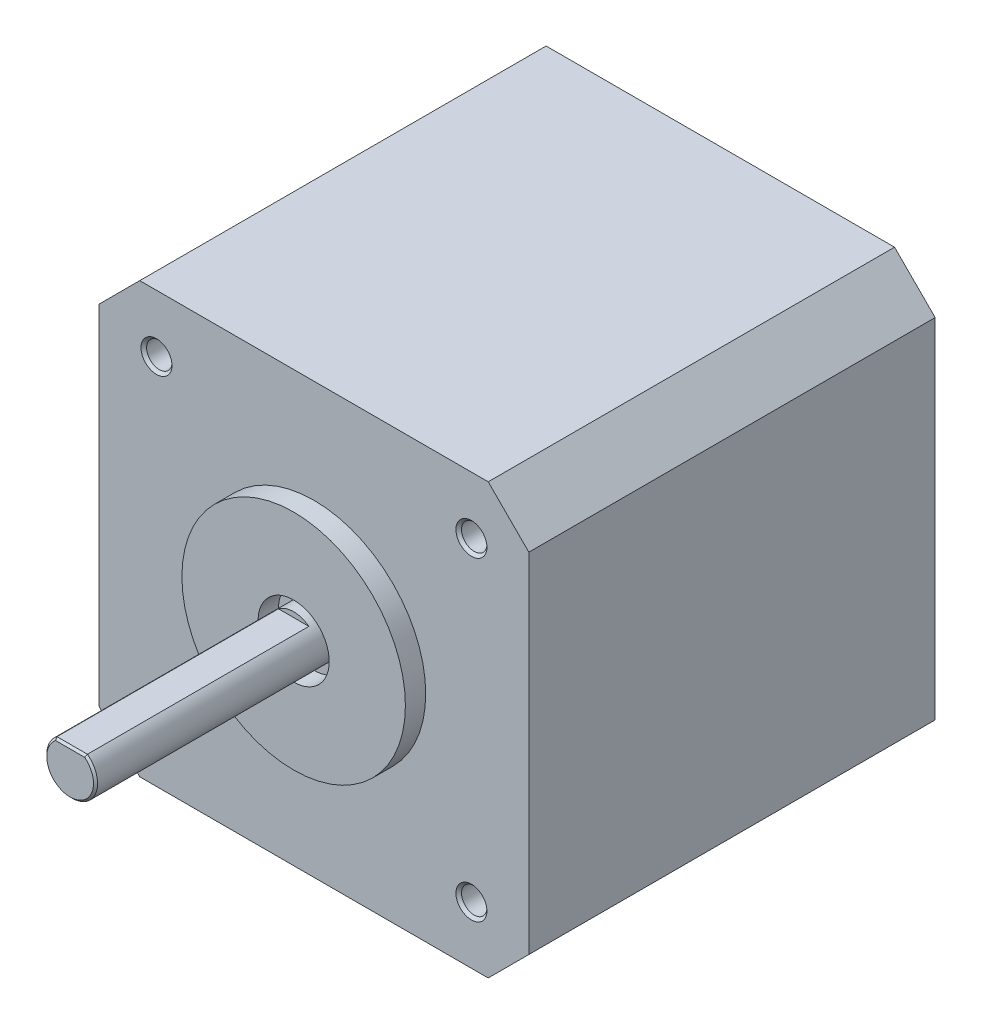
ISO-10303-21;
HEADER;
FILE_DESCRIPTION(('STEP AP214'),'2;1');
FILE_NAME('part.step','',(''),(''),'','','');
FILE_SCHEMA(('AUTOMOTIVE_DESIGN { 1 0 10303 214 1 1 1 1 }'));
ENDSEC;
DATA;
#1=APPLICATION_CONTEXT('core data for automotive mechanical design processes');
#2=APPLICATION_PROTOCOL_DEFINITION('international standard','automotive_design',2000,#1);
#3=PRODUCT_CONTEXT('',#1,'mechanical');
#4=PRODUCT('Part','Part','',(#3));
#5=PRODUCT_RELATED_PRODUCT_CATEGORY('part','',(#4));
#6=PRODUCT_DEFINITION_FORMATION('','',#4);
#7=PRODUCT_DEFINITION_CONTEXT('part definition',#1,'design');
#8=PRODUCT_DEFINITION('design','',#6,#7);
#9=PRODUCT_DEFINITION_SHAPE('','',#8);
#10=(LENGTH_UNIT() NAMED_UNIT(*) SI_UNIT(.MILLI.,.METRE.));
#11=(NAMED_UNIT(*) PLANE_ANGLE_UNIT() SI_UNIT($,.RADIAN.));
#12=(NAMED_UNIT(*) SI_UNIT($,.STERADIAN.) SOLID_ANGLE_UNIT());
#13=UNCERTAINTY_MEASURE_WITH_UNIT(LENGTH_MEASURE(1.E-05),#10,'distance_accuracy_value','');
#14=(GEOMETRIC_REPRESENTATION_CONTEXT(3) GLOBAL_UNCERTAINTY_ASSIGNED_CONTEXT((#13)) GLOBAL_UNIT_ASSIGNED_CONTEXT((#10,
#11,#12)) REPRESENTATION_CONTEXT('',''));
#15=CARTESIAN_POINT('',(0.,0.,0.));
#16=DIRECTION('',(0.,0.,1.));
#17=DIRECTION('',(1.,0.,0.));
#18=AXIS2_PLACEMENT_3D('',#15,#16,#17);
#19=CARTESIAN_POINT('',(21.15,21.15,40.));
#20=DIRECTION('',(-1.,0.,0.));
#21=DIRECTION('',(0.,-1.,0.));
#22=AXIS2_PLACEMENT_3D('',#19,#20,#21);
#23=PLANE('',#22);
#24=DIRECTION('',(0.,1.,0.));
#25=VECTOR('',#24,1.);
#26=CARTESIAN_POINT('',(21.15,21.15,40.));
#27=LINE('',#26,#25);
#28=CARTESIAN_POINT('',(21.15,-17.15,40.));
#29=VERTEX_POINT('',#28);
#30=CARTESIAN_POINT('',(21.15,17.15,40.));
#31=VERTEX_POINT('',#30);
#32=EDGE_CURVE('E209',#29,#31,#27,.T.);
#33=ORIENTED_EDGE('',*,*,#32,.F.);
#34=DIRECTION('',(0.,0.,-1.));
#35=VECTOR('',#34,1.);
#36=CARTESIAN_POINT('',(21.15,-17.15,40.));
#37=LINE('',#36,#35);
#38=CARTESIAN_POINT('',(21.15,-17.15,0.));
#39=VERTEX_POINT('',#38);
#40=EDGE_CURVE('E427',#29,#39,#37,.T.);
#41=ORIENTED_EDGE('',*,*,#40,.T.);
#42=DIRECTION('',(0.,1.,0.));
#43=VECTOR('',#42,1.);
#44=CARTESIAN_POINT('',(21.15,21.15,0.));
#45=LINE('',#44,#43);
#46=CARTESIAN_POINT('',(21.15,17.15,0.));
#47=VERTEX_POINT('',#46);
#48=EDGE_CURVE('E203',#39,#47,#45,.T.);
#49=ORIENTED_EDGE('',*,*,#48,.T.);
#50=DIRECTION('',(0.,0.,1.));
#51=VECTOR('',#50,1.);
#52=CARTESIAN_POINT('',(21.15,17.15,40.));
#53=LINE('',#52,#51);
#54=EDGE_CURVE('E240',#47,#31,#53,.T.);
#55=ORIENTED_EDGE('',*,*,#54,.T.);
#56=EDGE_LOOP('',(#33,#41,#49,#55));
#57=FACE_BOUND('',#56,.T.);
#58=ADVANCED_FACE('F45',(#57),#23,.F.);
#59=CARTESIAN_POINT('',(-21.15,21.15,40.));
#60=DIRECTION('',(0.,-1.,0.));
#61=DIRECTION('',(0.,0.,-1.));
#62=AXIS2_PLACEMENT_3D('',#59,#60,#61);
#63=PLANE('',#62);
#64=DIRECTION('',(-1.,0.,0.));
#65=VECTOR('',#64,1.);
#66=CARTESIAN_POINT('',(-21.15,21.15,40.));
#67=LINE('',#66,#65);
#68=CARTESIAN_POINT('',(17.15,21.15,40.));
#69=VERTEX_POINT('',#68);
#70=CARTESIAN_POINT('',(-17.15,21.15,40.));
#71=VERTEX_POINT('',#70);
#72=EDGE_CURVE('E212',#69,#71,#67,.T.);
#73=ORIENTED_EDGE('',*,*,#72,.F.);
#74=DIRECTION('',(0.,0.,-1.));
#75=VECTOR('',#74,1.);
#76=CARTESIAN_POINT('',(17.15,21.15,40.));
#77=LINE('',#76,#75);
#78=CARTESIAN_POINT('',(17.15,21.15,0.));
#79=VERTEX_POINT('',#78);
#80=EDGE_CURVE('E431',#69,#79,#77,.T.);
#81=ORIENTED_EDGE('',*,*,#80,.T.);
#82=DIRECTION('',(-1.,0.,0.));
#83=VECTOR('',#82,1.);
#84=CARTESIAN_POINT('',(-21.15,21.15,0.));
#85=LINE('',#84,#83);
#86=CARTESIAN_POINT('',(-17.15,21.15,0.));
#87=VERTEX_POINT('',#86);
#88=EDGE_CURVE('E221',#79,#87,#85,.T.);
#89=ORIENTED_EDGE('',*,*,#88,.T.);
#90=DIRECTION('',(0.,0.,1.));
#91=VECTOR('',#90,1.);
#92=CARTESIAN_POINT('',(-17.15,21.15,40.));
#93=LINE('',#92,#91);
#94=EDGE_CURVE('E428',#87,#71,#93,.T.);
#95=ORIENTED_EDGE('',*,*,#94,.T.);
#96=EDGE_LOOP('',(#73,#81,#89,#95));
#97=FACE_BOUND('',#96,.T.);
#98=ADVANCED_FACE('F293',(#97),#63,.F.);
#99=CARTESIAN_POINT('',(-21.15,21.15,40.));
#100=DIRECTION('',(1.,0.,0.));
#101=DIRECTION('',(0.,1.,0.));
#102=AXIS2_PLACEMENT_3D('',#99,#100,#101);
#103=PLANE('',#102);
#104=DIRECTION('',(0.,-1.,0.));
#105=VECTOR('',#104,1.);
#106=CARTESIAN_POINT('',(-21.15,21.15,0.));
#107=LINE('',#106,#105);
#108=CARTESIAN_POINT('',(-21.15,17.15,0.));
#109=VERTEX_POINT('',#108);
#110=CARTESIAN_POINT('',(-21.15,-17.15,0.));
#111=VERTEX_POINT('',#110);
#112=EDGE_CURVE('E224',#109,#111,#107,.T.);
#113=ORIENTED_EDGE('',*,*,#112,.T.);
#114=DIRECTION('',(0.,0.,1.));
#115=VECTOR('',#114,1.);
#116=CARTESIAN_POINT('',(-21.15,-17.15,40.));
#117=LINE('',#116,#115);
#118=CARTESIAN_POINT('',(-21.15,-17.15,40.));
#119=VERTEX_POINT('',#118);
#120=EDGE_CURVE('E11',#111,#119,#117,.T.);
#121=ORIENTED_EDGE('',*,*,#120,.T.);
#122=DIRECTION('',(0.,-1.,0.));
#123=VECTOR('',#122,1.);
#124=CARTESIAN_POINT('',(-21.15,21.15,40.));
#125=LINE('',#124,#123);
#126=CARTESIAN_POINT('',(-21.15,17.15,40.));
#127=VERTEX_POINT('',#126);
#128=EDGE_CURVE('E215',#127,#119,#125,.T.);
#129=ORIENTED_EDGE('',*,*,#128,.F.);
#130=DIRECTION('',(0.,0.,-1.));
#131=VECTOR('',#130,1.);
#132=CARTESIAN_POINT('',(-21.15,17.15,40.));
#133=LINE('',#132,#131);
#134=EDGE_CURVE('E54',#127,#109,#133,.T.);
#135=ORIENTED_EDGE('',*,*,#134,.T.);
#136=EDGE_LOOP('',(#113,#121,#129,#135));
#137=FACE_BOUND('',#136,.T.);
#138=ADVANCED_FACE('F298',(#137),#103,.F.);
#139=CARTESIAN_POINT('',(-21.15,-21.15,40.));
#140=DIRECTION('',(0.,1.,0.));
#141=DIRECTION('',(0.,0.,1.));
#142=AXIS2_PLACEMENT_3D('',#139,#140,#141);
#143=PLANE('',#142);
#144=DIRECTION('',(1.,0.,0.));
#145=VECTOR('',#144,1.);
#146=CARTESIAN_POINT('',(-21.15,-21.15,0.));
#147=LINE('',#146,#145);
#148=CARTESIAN_POINT('',(-17.15,-21.15,0.));
#149=VERTEX_POINT('',#148);
#150=CARTESIAN_POINT('',(17.15,-21.15,0.));
#151=VERTEX_POINT('',#150);
#152=EDGE_CURVE('E213',#149,#151,#147,.T.);
#153=ORIENTED_EDGE('',*,*,#152,.T.);
#154=DIRECTION('',(0.,0.,1.));
#155=VECTOR('',#154,1.);
#156=CARTESIAN_POINT('',(17.15,-21.15,40.));
#157=LINE('',#156,#155);
#158=CARTESIAN_POINT('',(17.15,-21.15,40.));
#159=VERTEX_POINT('',#158);
#160=EDGE_CURVE('E425',#151,#159,#157,.T.);
#161=ORIENTED_EDGE('',*,*,#160,.T.);
#162=DIRECTION('',(1.,0.,0.));
#163=VECTOR('',#162,1.);
#164=CARTESIAN_POINT('',(-21.15,-21.15,40.));
#165=LINE('',#164,#163);
#166=CARTESIAN_POINT('',(-17.15,-21.15,40.));
#167=VERTEX_POINT('',#166);
#168=EDGE_CURVE('E208',#167,#159,#165,.T.);
#169=ORIENTED_EDGE('',*,*,#168,.F.);
#170=DIRECTION('',(0.,0.,-1.));
#171=VECTOR('',#170,1.);
#172=CARTESIAN_POINT('',(-17.15,-21.15,40.));
#173=LINE('',#172,#171);
#174=EDGE_CURVE('E453',#167,#149,#173,.T.);
#175=ORIENTED_EDGE('',*,*,#174,.T.);
#176=EDGE_LOOP('',(#153,#161,#169,#175));
#177=FACE_BOUND('',#176,.T.);
#178=ADVANCED_FACE('F305',(#177),#143,.F.);
#179=CARTESIAN_POINT('',(0.,0.,40.));
#180=DIRECTION('',(0.,0.,1.));
#181=DIRECTION('',(1.,0.,0.));
#182=AXIS2_PLACEMENT_3D('',#179,#180,#181);
#183=PLANE('',#182);
#184=CARTESIAN_POINT('',(15.5,15.5,40.));
#185=DIRECTION('',(0.,0.,1.));
#186=DIRECTION('',(1.,0.,0.));
#187=AXIS2_PLACEMENT_3D('',#184,#185,#186);
#188=CIRCLE('',#187,1.525);
#189=CARTESIAN_POINT('',(17.025,15.5,40.));
#190=VERTEX_POINT('',#189);
#191=EDGE_CURVE('E156',#190,#190,#188,.T.);
#192=ORIENTED_EDGE('',*,*,#191,.F.);
#193=EDGE_LOOP('',(#192));
#194=FACE_BOUND('',#193,.T.);
#195=CARTESIAN_POINT('',(-15.5,15.5,40.));
#196=DIRECTION('',(0.,0.,1.));
#197=DIRECTION('',(1.,0.,0.));
#198=AXIS2_PLACEMENT_3D('',#195,#196,#197);
#199=CIRCLE('',#198,1.525);
#200=CARTESIAN_POINT('',(-13.975,15.5,40.));
#201=VERTEX_POINT('',#200);
#202=EDGE_CURVE('E149',#201,#201,#199,.T.);
#203=ORIENTED_EDGE('',*,*,#202,.F.);
#204=EDGE_LOOP('',(#203));
#205=FACE_BOUND('',#204,.T.);
#206=CARTESIAN_POINT('',(-15.5,-15.5,40.));
#207=DIRECTION('',(0.,0.,1.));
#208=DIRECTION('',(1.,0.,0.));
#209=AXIS2_PLACEMENT_3D('',#206,#207,#208);
#210=CIRCLE('',#209,1.525);
#211=CARTESIAN_POINT('',(-13.975,-15.5,40.));
#212=VERTEX_POINT('',#211);
#213=EDGE_CURVE('E165',#212,#212,#210,.T.);
#214=ORIENTED_EDGE('',*,*,#213,.F.);
#215=EDGE_LOOP('',(#214));
#216=FACE_BOUND('',#215,.T.);
#217=CARTESIAN_POINT('',(15.5,-15.5,40.));
#218=DIRECTION('',(0.,0.,1.));
#219=DIRECTION('',(1.,0.,0.));
#220=AXIS2_PLACEMENT_3D('',#217,#218,#219);
#221=CIRCLE('',#220,1.525);
#222=CARTESIAN_POINT('',(17.025,-15.5,40.));
#223=VERTEX_POINT('',#222);
#224=EDGE_CURVE('E174',#223,#223,#221,.T.);
#225=ORIENTED_EDGE('',*,*,#224,.F.);
#226=EDGE_LOOP('',(#225));
#227=FACE_BOUND('',#226,.T.);
#228=CARTESIAN_POINT('',(0.,0.,40.));
#229=DIRECTION('',(0.,0.,1.));
#230=DIRECTION('',(1.,0.,0.));
#231=AXIS2_PLACEMENT_3D('',#228,#229,#230);
#232=CIRCLE('',#231,11.);
#233=CARTESIAN_POINT('',(11.,0.,40.));
#234=VERTEX_POINT('',#233);
#235=EDGE_CURVE('E204',#234,#234,#232,.T.);
#236=ORIENTED_EDGE('',*,*,#235,.F.);
#237=EDGE_LOOP('',(#236));
#238=FACE_BOUND('',#237,.T.);
#239=ORIENTED_EDGE('',*,*,#168,.T.);
#240=DIRECTION('',(-0.707106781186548,-0.707106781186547,0.));
#241=VECTOR('',#240,1.);
#242=CARTESIAN_POINT('',(19.15,-19.15,40.));
#243=LINE('',#242,#241);
#244=EDGE_CURVE('E419',#159,#29,#243,.F.);
#245=ORIENTED_EDGE('',*,*,#244,.T.);
#246=ORIENTED_EDGE('',*,*,#32,.T.);
#247=DIRECTION('',(0.707106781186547,-0.707106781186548,0.));
#248=VECTOR('',#247,1.);
#249=CARTESIAN_POINT('',(19.15,19.15,40.));
#250=LINE('',#249,#248);
#251=EDGE_CURVE('E429',#31,#69,#250,.F.);
#252=ORIENTED_EDGE('',*,*,#251,.T.);
#253=ORIENTED_EDGE('',*,*,#72,.T.);
#254=DIRECTION('',(0.707106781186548,0.707106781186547,0.));
#255=VECTOR('',#254,1.);
#256=CARTESIAN_POINT('',(-19.15,19.15,40.));
#257=LINE('',#256,#255);
#258=EDGE_CURVE('E66',#71,#127,#257,.F.);
#259=ORIENTED_EDGE('',*,*,#258,.T.);
#260=ORIENTED_EDGE('',*,*,#128,.T.);
#261=DIRECTION('',(-0.707106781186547,0.707106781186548,0.));
#262=VECTOR('',#261,1.);
#263=CARTESIAN_POINT('',(-19.15,-19.15,40.));
#264=LINE('',#263,#262);
#265=EDGE_CURVE('E420',#119,#167,#264,.F.);
#266=ORIENTED_EDGE('',*,*,#265,.T.);
#267=EDGE_LOOP('',(#239,#245,#246,#252,#253,#259,#260,#266));
#268=FACE_BOUND('',#267,.T.);
#269=ADVANCED_FACE('F308',(#194,#205,#216,#227,#238,#268),#183,.T.);
#270=CARTESIAN_POINT('',(0.,0.,0.));
#271=DIRECTION('',(0.,0.,1.));
#272=DIRECTION('',(1.,0.,0.));
#273=AXIS2_PLACEMENT_3D('',#270,#271,#272);
#274=PLANE('',#273);
#275=ORIENTED_EDGE('',*,*,#48,.F.);
#276=DIRECTION('',(0.707106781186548,0.707106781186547,0.));
#277=VECTOR('',#276,1.);
#278=CARTESIAN_POINT('',(21.15,-17.15,0.));
#279=LINE('',#278,#277);
#280=EDGE_CURVE('E447',#39,#151,#279,.F.);
#281=ORIENTED_EDGE('',*,*,#280,.T.);
#282=ORIENTED_EDGE('',*,*,#152,.F.);
#283=DIRECTION('',(0.707106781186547,-0.707106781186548,0.));
#284=VECTOR('',#283,1.);
#285=CARTESIAN_POINT('',(-17.15,-21.15,0.));
#286=LINE('',#285,#284);
#287=EDGE_CURVE('E444',#149,#111,#286,.F.);
#288=ORIENTED_EDGE('',*,*,#287,.T.);
#289=ORIENTED_EDGE('',*,*,#112,.F.);
#290=DIRECTION('',(-0.707106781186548,-0.707106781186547,0.));
#291=VECTOR('',#290,1.);
#292=CARTESIAN_POINT('',(-21.15,17.15,0.));
#293=LINE('',#292,#291);
#294=EDGE_CURVE('E442',#109,#87,#293,.F.);
#295=ORIENTED_EDGE('',*,*,#294,.T.);
#296=ORIENTED_EDGE('',*,*,#88,.F.);
#297=DIRECTION('',(-0.707106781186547,0.707106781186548,0.));
#298=VECTOR('',#297,1.);
#299=CARTESIAN_POINT('',(17.15,21.15,0.));
#300=LINE('',#299,#298);
#301=EDGE_CURVE('E445',#79,#47,#300,.F.);
#302=ORIENTED_EDGE('',*,*,#301,.T.);
#303=EDGE_LOOP('',(#275,#281,#282,#288,#289,#295,#296,#302));
#304=FACE_BOUND('',#303,.T.);
#305=ADVANCED_FACE('F310',(#304),#274,.F.);
#306=CARTESIAN_POINT('',(0.,0.,42.));
#307=DIRECTION('',(0.,0.,-1.));
#308=DIRECTION('',(-1.,0.,0.));
#309=AXIS2_PLACEMENT_3D('',#306,#307,#308);
#310=CYLINDRICAL_SURFACE('',#309,11.);
#311=CARTESIAN_POINT('',(0.,0.,42.));
#312=DIRECTION('',(0.,0.,1.));
#313=DIRECTION('',(1.,0.,0.));
#314=AXIS2_PLACEMENT_3D('',#311,#312,#313);
#315=CIRCLE('',#314,11.);
#316=CARTESIAN_POINT('',(11.,0.,42.));
#317=VERTEX_POINT('',#316);
#318=EDGE_CURVE('E198',#317,#317,#315,.T.);
#319=ORIENTED_EDGE('',*,*,#318,.F.);
#320=EDGE_LOOP('',(#319));
#321=FACE_BOUND('',#320,.T.);
#322=ORIENTED_EDGE('',*,*,#235,.T.);
#323=EDGE_LOOP('',(#322));
#324=FACE_BOUND('',#323,.T.);
#325=ADVANCED_FACE('F313',(#321,#324),#310,.T.);
#326=CARTESIAN_POINT('',(0.,0.,42.));
#327=DIRECTION('',(0.,0.,1.));
#328=DIRECTION('',(1.,0.,0.));
#329=AXIS2_PLACEMENT_3D('',#326,#327,#328);
#330=PLANE('',#329);
#331=CARTESIAN_POINT('',(0.,0.,42.));
#332=DIRECTION('',(0.,0.,1.));
#333=DIRECTION('',(1.,0.,0.));
#334=AXIS2_PLACEMENT_3D('',#331,#332,#333);
#335=CIRCLE('',#334,3.5);
#336=CARTESIAN_POINT('',(3.5,0.,42.));
#337=VERTEX_POINT('',#336);
#338=EDGE_CURVE('E194',#337,#337,#335,.T.);
#339=ORIENTED_EDGE('',*,*,#338,.F.);
#340=EDGE_LOOP('',(#339));
#341=FACE_BOUND('',#340,.T.);
#342=ORIENTED_EDGE('',*,*,#318,.T.);
#343=EDGE_LOOP('',(#342));
#344=FACE_BOUND('',#343,.T.);
#345=ADVANCED_FACE('F320',(#341,#344),#330,.T.);
#346=CARTESIAN_POINT('',(0.,0.,40.));
#347=DIRECTION('',(0.,0.,1.));
#348=DIRECTION('',(1.,0.,0.));
#349=AXIS2_PLACEMENT_3D('',#346,#347,#348);
#350=CYLINDRICAL_SURFACE('',#349,3.5);
#351=CARTESIAN_POINT('',(0.,0.,40.));
#352=DIRECTION('',(0.,0.,1.));
#353=DIRECTION('',(1.,0.,0.));
#354=AXIS2_PLACEMENT_3D('',#351,#352,#353);
#355=CIRCLE('',#354,3.5);
#356=CARTESIAN_POINT('',(3.5,0.,40.));
#357=VERTEX_POINT('',#356);
#358=EDGE_CURVE('E195',#357,#357,#355,.T.);
#359=ORIENTED_EDGE('',*,*,#358,.F.);
#360=EDGE_LOOP('',(#359));
#361=FACE_BOUND('',#360,.T.);
#362=ORIENTED_EDGE('',*,*,#338,.T.);
#363=EDGE_LOOP('',(#362));
#364=FACE_BOUND('',#363,.T.);
#365=ADVANCED_FACE('F324',(#361,#364),#350,.F.);
#366=CARTESIAN_POINT('',(0.,0.,40.));
#367=DIRECTION('',(0.,0.,1.));
#368=DIRECTION('',(1.,0.,0.));
#369=AXIS2_PLACEMENT_3D('',#366,#367,#368);
#370=PLANE('',#369);
#371=CARTESIAN_POINT('',(0.,0.,40.));
#372=DIRECTION('',(0.,0.,1.));
#373=DIRECTION('',(1.,0.,0.));
#374=AXIS2_PLACEMENT_3D('',#371,#372,#373);
#375=CIRCLE('',#374,2.5);
#376=CARTESIAN_POINT('',(2.5,0.,40.));
#377=VERTEX_POINT('',#376);
#378=EDGE_CURVE('E191',#377,#377,#375,.T.);
#379=ORIENTED_EDGE('',*,*,#378,.F.);
#380=EDGE_LOOP('',(#379));
#381=FACE_BOUND('',#380,.T.);
#382=ORIENTED_EDGE('',*,*,#358,.T.);
#383=EDGE_LOOP('',(#382));
#384=FACE_BOUND('',#383,.T.);
#385=ADVANCED_FACE('F328',(#381,#384),#370,.T.);
#386=CARTESIAN_POINT('',(0.,0.,64.));
#387=DIRECTION('',(0.,0.,-1.));
#388=DIRECTION('',(-1.,0.,0.));
#389=AXIS2_PLACEMENT_3D('',#386,#387,#388);
#390=CYLINDRICAL_SURFACE('',#389,2.5);
#391=DIRECTION('',(0.,0.,-1.));
#392=VECTOR('',#391,1.);
#393=CARTESIAN_POINT('',(1.5,2.,64.));
#394=LINE('',#393,#392);
#395=CARTESIAN_POINT('',(1.5,2.,42.));
#396=VERTEX_POINT('',#395);
#397=CARTESIAN_POINT('',(1.5,2.,63.8));
#398=VERTEX_POINT('',#397);
#399=EDGE_CURVE('E186',#396,#398,#394,.F.);
#400=ORIENTED_EDGE('',*,*,#399,.T.);
#401=CARTESIAN_POINT('',(0.,0.,63.8));
#402=DIRECTION('',(0.,0.,1.));
#403=DIRECTION('',(1.,0.,0.));
#404=AXIS2_PLACEMENT_3D('',#401,#402,#403);
#405=CIRCLE('',#404,2.5);
#406=CARTESIAN_POINT('',(-1.5,2.,63.8));
#407=VERTEX_POINT('',#406);
#408=EDGE_CURVE('E235',#398,#407,#405,.F.);
#409=ORIENTED_EDGE('',*,*,#408,.T.);
#410=DIRECTION('',(0.,0.,-1.));
#411=VECTOR('',#410,1.);
#412=CARTESIAN_POINT('',(-1.5,2.,64.));
#413=LINE('',#412,#411);
#414=CARTESIAN_POINT('',(-1.5,2.,42.));
#415=VERTEX_POINT('',#414);
#416=EDGE_CURVE('E189',#407,#415,#413,.T.);
#417=ORIENTED_EDGE('',*,*,#416,.T.);
#418=CARTESIAN_POINT('',(0.,0.,42.));
#419=DIRECTION('',(0.,0.,1.));
#420=DIRECTION('',(1.,0.,0.));
#421=AXIS2_PLACEMENT_3D('',#418,#419,#420);
#422=CIRCLE('',#421,2.5);
#423=EDGE_CURVE('E207',#396,#415,#422,.T.);
#424=ORIENTED_EDGE('',*,*,#423,.F.);
#425=EDGE_LOOP('',(#400,#409,#417,#424));
#426=FACE_BOUND('',#425,.T.);
#427=ORIENTED_EDGE('',*,*,#378,.T.);
#428=EDGE_LOOP('',(#427));
#429=FACE_BOUND('',#428,.T.);
#430=ADVANCED_FACE('F332',(#426,#429),#390,.T.);
#431=CARTESIAN_POINT('',(0.,0.,64.));
#432=DIRECTION('',(0.,0.,1.));
#433=DIRECTION('',(1.,0.,0.));
#434=AXIS2_PLACEMENT_3D('',#431,#432,#433);
#435=PLANE('',#434);
#436=DIRECTION('',(-1.,0.,0.));
#437=VECTOR('',#436,1.);
#438=CARTESIAN_POINT('',(-1.5,1.79999999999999,64.));
#439=LINE('',#438,#437);
#440=CARTESIAN_POINT('',(1.43178210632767,1.79999999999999,64.));
#441=VERTEX_POINT('',#440);
#442=CARTESIAN_POINT('',(-1.43178210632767,1.79999999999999,64.));
#443=VERTEX_POINT('',#442);
#444=EDGE_CURVE('E230',#441,#443,#439,.T.);
#445=ORIENTED_EDGE('',*,*,#444,.T.);
#446=CARTESIAN_POINT('',(0.,0.,64.));
#447=DIRECTION('',(0.,0.,1.));
#448=DIRECTION('',(1.,0.,0.));
#449=AXIS2_PLACEMENT_3D('',#446,#447,#448);
#450=CIRCLE('',#449,2.29999999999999);
#451=EDGE_CURVE('E232',#443,#441,#450,.T.);
#452=ORIENTED_EDGE('',*,*,#451,.T.);
#453=EDGE_LOOP('',(#445,#452));
#454=FACE_BOUND('',#453,.T.);
#455=ADVANCED_FACE('F336',(#454),#435,.T.);
#456=CARTESIAN_POINT('',(0.,0.,42.));
#457=DIRECTION('',(0.,0.,1.));
#458=DIRECTION('',(1.,0.,0.));
#459=AXIS2_PLACEMENT_3D('',#456,#457,#458);
#460=PLANE('',#459);
#461=ORIENTED_EDGE('',*,*,#423,.T.);
#462=DIRECTION('',(1.,0.,0.));
#463=VECTOR('',#462,1.);
#464=CARTESIAN_POINT('',(-2.5,2.,42.));
#465=LINE('',#464,#463);
#466=EDGE_CURVE('E183',#415,#396,#465,.T.);
#467=ORIENTED_EDGE('',*,*,#466,.T.);
#468=EDGE_LOOP('',(#461,#467));
#469=FACE_BOUND('',#468,.T.);
#470=ADVANCED_FACE('F340',(#469),#460,.T.);
#471=CARTESIAN_POINT('',(-2.5,2.,42.));
#472=DIRECTION('',(0.,-1.,0.));
#473=DIRECTION('',(0.,0.,-1.));
#474=AXIS2_PLACEMENT_3D('',#471,#472,#473);
#475=PLANE('',#474);
#476=ORIENTED_EDGE('',*,*,#416,.F.);
#477=DIRECTION('',(1.,0.,0.));
#478=VECTOR('',#477,1.);
#479=CARTESIAN_POINT('',(1.5,2.,63.8));
#480=LINE('',#479,#478);
#481=EDGE_CURVE('E238',#407,#398,#480,.T.);
#482=ORIENTED_EDGE('',*,*,#481,.T.);
#483=ORIENTED_EDGE('',*,*,#399,.F.);
#484=ORIENTED_EDGE('',*,*,#466,.F.);
#485=EDGE_LOOP('',(#476,#482,#483,#484));
#486=FACE_BOUND('',#485,.T.);
#487=ADVANCED_FACE('F342',(#486),#475,.F.);
#488=CARTESIAN_POINT('',(15.5,-15.5,31.5));
#489=DIRECTION('',(0.,0.,1.));
#490=DIRECTION('',(1.,0.,0.));
#491=AXIS2_PLACEMENT_3D('',#488,#489,#490);
#492=CONICAL_SURFACE('',#491,1.25,1.02974425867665);
#493=CARTESIAN_POINT('',(15.5,-15.5,30.7489242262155));
#494=VERTEX_POINT('',#493);
#495=VERTEX_LOOP('',#494);
#496=FACE_BOUND('',#495,.T.);
#497=CARTESIAN_POINT('',(15.5,-15.5,31.5));
#498=DIRECTION('',(0.,0.,1.));
#499=DIRECTION('',(1.,0.,0.));
#500=AXIS2_PLACEMENT_3D('',#497,#498,#499);
#501=CIRCLE('',#500,1.25);
#502=CARTESIAN_POINT('',(16.75,-15.5,31.5));
#503=VERTEX_POINT('',#502);
#504=EDGE_CURVE('E180',#503,#503,#501,.T.);
#505=ORIENTED_EDGE('',*,*,#504,.T.);
#506=EDGE_LOOP('',(#505));
#507=FACE_BOUND('',#506,.T.);
#508=ADVANCED_FACE('F345',(#496,#507),#492,.F.);
#509=CARTESIAN_POINT('',(15.5,-15.5,40.));
#510=DIRECTION('',(0.,0.,1.));
#511=DIRECTION('',(1.,0.,0.));
#512=AXIS2_PLACEMENT_3D('',#509,#510,#511);
#513=CYLINDRICAL_SURFACE('',#512,1.25);
#514=ORIENTED_EDGE('',*,*,#504,.F.);
#515=EDGE_LOOP('',(#514));
#516=FACE_BOUND('',#515,.T.);
#517=CARTESIAN_POINT('',(15.5,-15.5,39.725));
#518=DIRECTION('',(0.,0.,1.));
#519=DIRECTION('',(1.,0.,0.));
#520=AXIS2_PLACEMENT_3D('',#517,#518,#519);
#521=CIRCLE('',#520,1.25);
#522=CARTESIAN_POINT('',(16.75,-15.5,39.725));
#523=VERTEX_POINT('',#522);
#524=EDGE_CURVE('E177',#523,#523,#521,.T.);
#525=ORIENTED_EDGE('',*,*,#524,.T.);
#526=EDGE_LOOP('',(#525));
#527=FACE_BOUND('',#526,.T.);
#528=ADVANCED_FACE('F352',(#516,#527),#513,.F.);
#529=CARTESIAN_POINT('',(15.5,-15.5,40.));
#530=DIRECTION('',(0.,0.,1.));
#531=DIRECTION('',(1.,0.,0.));
#532=AXIS2_PLACEMENT_3D('',#529,#530,#531);
#533=CONICAL_SURFACE('',#532,1.525,0.785398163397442);
#534=ORIENTED_EDGE('',*,*,#524,.F.);
#535=EDGE_LOOP('',(#534));
#536=FACE_BOUND('',#535,.T.);
#537=ORIENTED_EDGE('',*,*,#224,.T.);
#538=EDGE_LOOP('',(#537));
#539=FACE_BOUND('',#538,.T.);
#540=ADVANCED_FACE('F356',(#536,#539),#533,.F.);
#541=CARTESIAN_POINT('',(-15.5,-15.5,31.5));
#542=DIRECTION('',(0.,0.,1.));
#543=DIRECTION('',(1.,0.,0.));
#544=AXIS2_PLACEMENT_3D('',#541,#542,#543);
#545=CONICAL_SURFACE('',#544,1.25,1.02974425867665);
#546=CARTESIAN_POINT('',(-15.5,-15.5,30.7489242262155));
#547=VERTEX_POINT('',#546);
#548=VERTEX_LOOP('',#547);
#549=FACE_BOUND('',#548,.T.);
#550=CARTESIAN_POINT('',(-15.5,-15.5,31.5));
#551=DIRECTION('',(0.,0.,1.));
#552=DIRECTION('',(1.,0.,0.));
#553=AXIS2_PLACEMENT_3D('',#550,#551,#552);
#554=CIRCLE('',#553,1.25);
#555=CARTESIAN_POINT('',(-14.25,-15.5,31.5));
#556=VERTEX_POINT('',#555);
#557=EDGE_CURVE('E171',#556,#556,#554,.T.);
#558=ORIENTED_EDGE('',*,*,#557,.T.);
#559=EDGE_LOOP('',(#558));
#560=FACE_BOUND('',#559,.T.);
#561=ADVANCED_FACE('F360',(#549,#560),#545,.F.);
#562=CARTESIAN_POINT('',(-15.5,-15.5,40.));
#563=DIRECTION('',(0.,0.,1.));
#564=DIRECTION('',(1.,0.,0.));
#565=AXIS2_PLACEMENT_3D('',#562,#563,#564);
#566=CYLINDRICAL_SURFACE('',#565,1.25);
#567=ORIENTED_EDGE('',*,*,#557,.F.);
#568=EDGE_LOOP('',(#567));
#569=FACE_BOUND('',#568,.T.);
#570=CARTESIAN_POINT('',(-15.5,-15.5,39.725));
#571=DIRECTION('',(0.,0.,1.));
#572=DIRECTION('',(1.,0.,0.));
#573=AXIS2_PLACEMENT_3D('',#570,#571,#572);
#574=CIRCLE('',#573,1.25);
#575=CARTESIAN_POINT('',(-14.25,-15.5,39.725));
#576=VERTEX_POINT('',#575);
#577=EDGE_CURVE('E168',#576,#576,#574,.T.);
#578=ORIENTED_EDGE('',*,*,#577,.T.);
#579=EDGE_LOOP('',(#578));
#580=FACE_BOUND('',#579,.T.);
#581=ADVANCED_FACE('F364',(#569,#580),#566,.F.);
#582=CARTESIAN_POINT('',(-15.5,-15.5,40.));
#583=DIRECTION('',(0.,0.,1.));
#584=DIRECTION('',(1.,0.,0.));
#585=AXIS2_PLACEMENT_3D('',#582,#583,#584);
#586=CONICAL_SURFACE('',#585,1.525,0.785398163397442);
#587=ORIENTED_EDGE('',*,*,#577,.F.);
#588=EDGE_LOOP('',(#587));
#589=FACE_BOUND('',#588,.T.);
#590=ORIENTED_EDGE('',*,*,#213,.T.);
#591=EDGE_LOOP('',(#590));
#592=FACE_BOUND('',#591,.T.);
#593=ADVANCED_FACE('F368',(#589,#592),#586,.F.);
#594=CARTESIAN_POINT('',(-15.5,15.5,31.5));
#595=DIRECTION('',(0.,0.,1.));
#596=DIRECTION('',(1.,0.,0.));
#597=AXIS2_PLACEMENT_3D('',#594,#595,#596);
#598=CONICAL_SURFACE('',#597,1.25,1.02974425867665);
#599=CARTESIAN_POINT('',(-15.5,15.5,30.7489242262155));
#600=VERTEX_POINT('',#599);
#601=VERTEX_LOOP('',#600);
#602=FACE_BOUND('',#601,.T.);
#603=CARTESIAN_POINT('',(-15.5,15.5,31.5));
#604=DIRECTION('',(0.,0.,1.));
#605=DIRECTION('',(1.,0.,0.));
#606=AXIS2_PLACEMENT_3D('',#603,#604,#605);
#607=CIRCLE('',#606,1.25);
#608=CARTESIAN_POINT('',(-14.25,15.5,31.5));
#609=VERTEX_POINT('',#608);
#610=EDGE_CURVE('E162',#609,#609,#607,.T.);
#611=ORIENTED_EDGE('',*,*,#610,.T.);
#612=EDGE_LOOP('',(#611));
#613=FACE_BOUND('',#612,.T.);
#614=ADVANCED_FACE('F372',(#602,#613),#598,.F.);
#615=CARTESIAN_POINT('',(-15.5,15.5,40.));
#616=DIRECTION('',(0.,0.,1.));
#617=DIRECTION('',(1.,0.,0.));
#618=AXIS2_PLACEMENT_3D('',#615,#616,#617);
#619=CYLINDRICAL_SURFACE('',#618,1.25);
#620=ORIENTED_EDGE('',*,*,#610,.F.);
#621=EDGE_LOOP('',(#620));
#622=FACE_BOUND('',#621,.T.);
#623=CARTESIAN_POINT('',(-15.5,15.5,39.725));
#624=DIRECTION('',(0.,0.,1.));
#625=DIRECTION('',(1.,0.,0.));
#626=AXIS2_PLACEMENT_3D('',#623,#624,#625);
#627=CIRCLE('',#626,1.25);
#628=CARTESIAN_POINT('',(-14.25,15.5,39.725));
#629=VERTEX_POINT('',#628);
#630=EDGE_CURVE('E153',#629,#629,#627,.T.);
#631=ORIENTED_EDGE('',*,*,#630,.T.);
#632=EDGE_LOOP('',(#631));
#633=FACE_BOUND('',#632,.T.);
#634=ADVANCED_FACE('F376',(#622,#633),#619,.F.);
#635=CARTESIAN_POINT('',(-15.5,15.5,40.));
#636=DIRECTION('',(0.,0.,1.));
#637=DIRECTION('',(1.,0.,0.));
#638=AXIS2_PLACEMENT_3D('',#635,#636,#637);
#639=CONICAL_SURFACE('',#638,1.525,0.785398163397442);
#640=ORIENTED_EDGE('',*,*,#630,.F.);
#641=EDGE_LOOP('',(#640));
#642=FACE_BOUND('',#641,.T.);
#643=ORIENTED_EDGE('',*,*,#202,.T.);
#644=EDGE_LOOP('',(#643));
#645=FACE_BOUND('',#644,.T.);
#646=ADVANCED_FACE('F143',(#642,#645),#639,.F.);
#647=CARTESIAN_POINT('',(15.5,15.5,31.5));
#648=DIRECTION('',(0.,0.,1.));
#649=DIRECTION('',(1.,0.,0.));
#650=AXIS2_PLACEMENT_3D('',#647,#648,#649);
#651=CONICAL_SURFACE('',#650,1.25,1.02974425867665);
#652=CARTESIAN_POINT('',(15.5,15.5,30.7489242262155));
#653=VERTEX_POINT('',#652);
#654=VERTEX_LOOP('',#653);
#655=FACE_BOUND('',#654,.T.);
#656=CARTESIAN_POINT('',(15.5,15.5,31.5));
#657=DIRECTION('',(0.,0.,1.));
#658=DIRECTION('',(1.,0.,0.));
#659=AXIS2_PLACEMENT_3D('',#656,#657,#658);
#660=CIRCLE('',#659,1.25);
#661=CARTESIAN_POINT('',(16.75,15.5,31.5));
#662=VERTEX_POINT('',#661);
#663=EDGE_CURVE('E147',#662,#662,#660,.T.);
#664=ORIENTED_EDGE('',*,*,#663,.T.);
#665=EDGE_LOOP('',(#664));
#666=FACE_BOUND('',#665,.T.);
#667=ADVANCED_FACE('F139',(#655,#666),#651,.F.);
#668=CARTESIAN_POINT('',(15.5,15.5,40.));
#669=DIRECTION('',(0.,0.,1.));
#670=DIRECTION('',(1.,0.,0.));
#671=AXIS2_PLACEMENT_3D('',#668,#669,#670);
#672=CYLINDRICAL_SURFACE('',#671,1.25);
#673=ORIENTED_EDGE('',*,*,#663,.F.);
#674=EDGE_LOOP('',(#673));
#675=FACE_BOUND('',#674,.T.);
#676=CARTESIAN_POINT('',(15.5,15.5,39.725));
#677=DIRECTION('',(0.,0.,1.));
#678=DIRECTION('',(1.,0.,0.));
#679=AXIS2_PLACEMENT_3D('',#676,#677,#678);
#680=CIRCLE('',#679,1.25);
#681=CARTESIAN_POINT('',(16.75,15.5,39.725));
#682=VERTEX_POINT('',#681);
#683=EDGE_CURVE('E150',#682,#682,#680,.T.);
#684=ORIENTED_EDGE('',*,*,#683,.T.);
#685=EDGE_LOOP('',(#684));
#686=FACE_BOUND('',#685,.T.);
#687=ADVANCED_FACE('F142',(#675,#686),#672,.F.);
#688=CARTESIAN_POINT('',(15.5,15.5,40.));
#689=DIRECTION('',(0.,0.,1.));
#690=DIRECTION('',(1.,0.,0.));
#691=AXIS2_PLACEMENT_3D('',#688,#689,#690);
#692=CONICAL_SURFACE('',#691,1.525,0.785398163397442);
#693=ORIENTED_EDGE('',*,*,#683,.F.);
#694=EDGE_LOOP('',(#693));
#695=FACE_BOUND('',#694,.T.);
#696=ORIENTED_EDGE('',*,*,#191,.T.);
#697=EDGE_LOOP('',(#696));
#698=FACE_BOUND('',#697,.T.);
#699=ADVANCED_FACE('F386',(#695,#698),#692,.F.);
#700=CARTESIAN_POINT('',(-2.5,2.,63.8));
#701=DIRECTION('',(0.,0.707106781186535,0.70710678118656));
#702=DIRECTION('',(-1.,0.,0.));
#703=AXIS2_PLACEMENT_3D('',#700,#701,#702);
#704=PLANE('',#703);
#705=CARTESIAN_POINT('',(1.43178210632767,1.79999999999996,64.));
#706=CARTESIAN_POINT('',(1.44340173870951,1.83329071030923,63.9667092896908));
#707=CARTESIAN_POINT('',(1.45489638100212,1.86660273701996,63.93339726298));
#708=CARTESIAN_POINT('',(1.47763567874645,1.93326940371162,63.8667305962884));
#709=CARTESIAN_POINT('',(1.48888033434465,1.96662404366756,63.8333759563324));
#710=CARTESIAN_POINT('',(1.50000000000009,1.99999999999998,63.8));
#711=B_SPLINE_CURVE_WITH_KNOTS('',3,(#705,#706,#707,#708,#709,#710),.UNSPECIFIED.,.F.,.F.,(4,2,
4),(0.,0.14547708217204,0.290954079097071),.UNSPECIFIED.);
#712=EDGE_CURVE('E241',#398,#441,#711,.F.);
#713=ORIENTED_EDGE('',*,*,#712,.F.);
#714=ORIENTED_EDGE('',*,*,#481,.F.);
#715=CARTESIAN_POINT('',(-1.5,2.,63.8));
#716=CARTESIAN_POINT('',(-1.48888033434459,1.96662404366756,63.8333759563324));
#717=CARTESIAN_POINT('',(-1.47763567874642,1.93326940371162,63.8667305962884));
#718=CARTESIAN_POINT('',(-1.45489638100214,1.86660273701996,63.93339726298));
#719=CARTESIAN_POINT('',(-1.44340173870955,1.83329071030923,63.9667092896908));
#720=CARTESIAN_POINT('',(-1.43178210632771,1.79999999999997,64.));
#721=B_SPLINE_CURVE_WITH_KNOTS('',3,(#715,#716,#717,#718,#719,#720),.UNSPECIFIED.,.F.,.F.,(4,2,
4),(0.,0.14547699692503,0.290954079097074),.UNSPECIFIED.);
#722=EDGE_CURVE('E249',#443,#407,#721,.F.);
#723=ORIENTED_EDGE('',*,*,#722,.F.);
#724=ORIENTED_EDGE('',*,*,#444,.F.);
#725=EDGE_LOOP('',(#713,#714,#723,#724));
#726=FACE_BOUND('',#725,.T.);
#727=ADVANCED_FACE('F256',(#726),#704,.T.);
#728=CARTESIAN_POINT('',(0.,0.,64.));
#729=DIRECTION('',(0.,0.,-1.));
#730=DIRECTION('',(-1.,0.,0.));
#731=AXIS2_PLACEMENT_3D('',#728,#729,#730);
#732=CONICAL_SURFACE('',#731,2.29999999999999,0.785398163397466);
#733=ORIENTED_EDGE('',*,*,#722,.T.);
#734=ORIENTED_EDGE('',*,*,#408,.F.);
#735=ORIENTED_EDGE('',*,*,#712,.T.);
#736=ORIENTED_EDGE('',*,*,#451,.F.);
#737=EDGE_LOOP('',(#733,#734,#735,#736));
#738=FACE_BOUND('',#737,.T.);
#739=ADVANCED_FACE('F260',(#738),#732,.T.);
#740=CARTESIAN_POINT('',(21.15,-17.15,40.));
#741=DIRECTION('',(-0.707106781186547,0.707106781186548,0.));
#742=DIRECTION('',(0.,0.,-1.));
#743=AXIS2_PLACEMENT_3D('',#740,#741,#742);
#744=PLANE('',#743);
#745=ORIENTED_EDGE('',*,*,#244,.F.);
#746=ORIENTED_EDGE('',*,*,#160,.F.);
#747=ORIENTED_EDGE('',*,*,#280,.F.);
#748=ORIENTED_EDGE('',*,*,#40,.F.);
#749=EDGE_LOOP('',(#745,#746,#747,#748));
#750=FACE_BOUND('',#749,.T.);
#751=ADVANCED_FACE('F266',(#750),#744,.F.);
#752=CARTESIAN_POINT('',(17.15,21.15,40.));
#753=DIRECTION('',(-0.707106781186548,-0.707106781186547,0.));
#754=DIRECTION('',(0.,0.,-1.));
#755=AXIS2_PLACEMENT_3D('',#752,#753,#754);
#756=PLANE('',#755);
#757=ORIENTED_EDGE('',*,*,#251,.F.);
#758=ORIENTED_EDGE('',*,*,#54,.F.);
#759=ORIENTED_EDGE('',*,*,#301,.F.);
#760=ORIENTED_EDGE('',*,*,#80,.F.);
#761=EDGE_LOOP('',(#757,#758,#759,#760));
#762=FACE_BOUND('',#761,.T.);
#763=ADVANCED_FACE('F275',(#762),#756,.F.);
#764=CARTESIAN_POINT('',(-17.15,-21.15,40.));
#765=DIRECTION('',(0.707106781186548,0.707106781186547,0.));
#766=DIRECTION('',(0.,0.,-1.));
#767=AXIS2_PLACEMENT_3D('',#764,#765,#766);
#768=PLANE('',#767);
#769=ORIENTED_EDGE('',*,*,#265,.F.);
#770=ORIENTED_EDGE('',*,*,#120,.F.);
#771=ORIENTED_EDGE('',*,*,#287,.F.);
#772=ORIENTED_EDGE('',*,*,#174,.F.);
#773=EDGE_LOOP('',(#769,#770,#771,#772));
#774=FACE_BOUND('',#773,.T.);
#775=ADVANCED_FACE('F281',(#774),#768,.F.);
#776=CARTESIAN_POINT('',(-21.15,17.15,40.));
#777=DIRECTION('',(0.707106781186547,-0.707106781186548,0.));
#778=DIRECTION('',(0.,0.,-1.));
#779=AXIS2_PLACEMENT_3D('',#776,#777,#778);
#780=PLANE('',#779);
#781=ORIENTED_EDGE('',*,*,#258,.F.);
#782=ORIENTED_EDGE('',*,*,#94,.F.);
#783=ORIENTED_EDGE('',*,*,#294,.F.);
#784=ORIENTED_EDGE('',*,*,#134,.F.);
#785=EDGE_LOOP('',(#781,#782,#783,#784));
#786=FACE_BOUND('',#785,.T.);
#787=ADVANCED_FACE('F48',(#786),#780,.F.);
#788=CLOSED_SHELL('',(#58,#98,#138,#178,#269,#305,#325,#345,#365,#385,#430,#455,#470,#487,#508,
#528,#540,#561,#581,#593,#614,#634,#646,#667,#687,#699,#727,#739,#751,#763,#775,#787));
#789=MANIFOLD_SOLID_BREP('B2',#788);
#790=ADVANCED_BREP_SHAPE_REPRESENTATION('',(#18,#789),#14);
#791=SHAPE_DEFINITION_REPRESENTATION(#9,#790);
ENDSEC;
END-ISO-10303-21;
